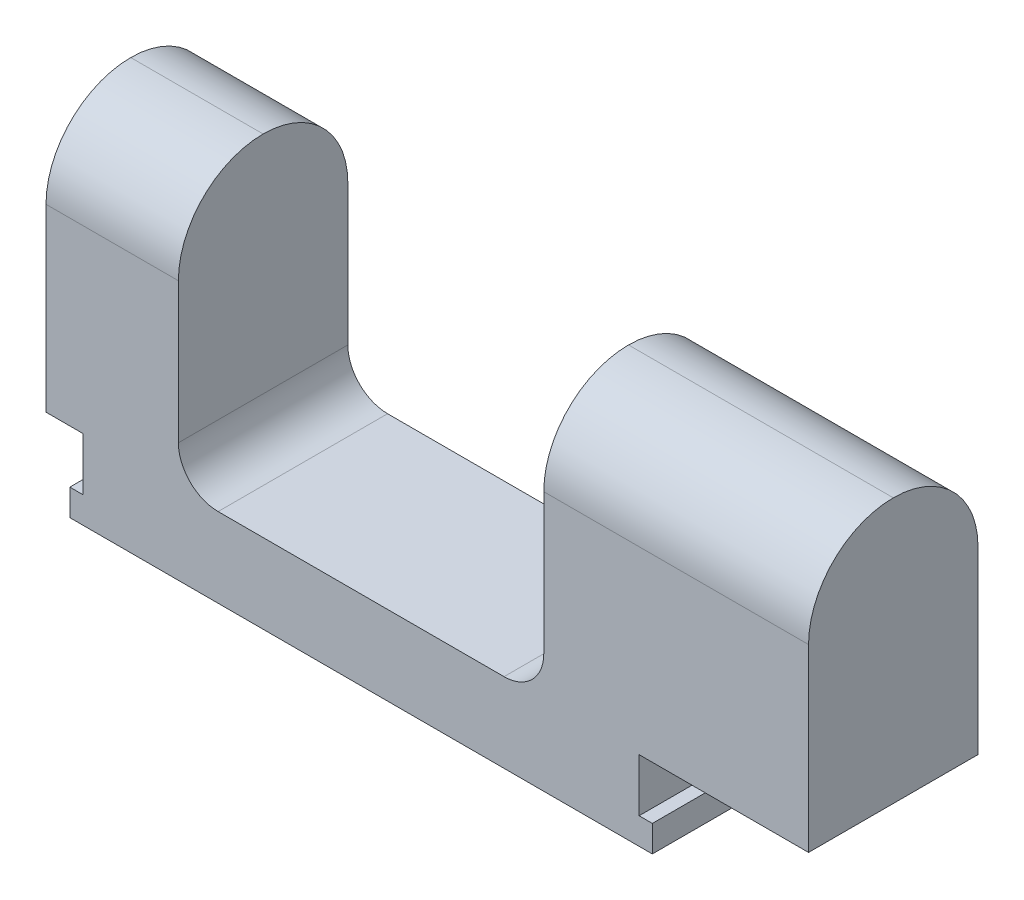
ISO-10303-21;
HEADER;
FILE_DESCRIPTION(('STEP AP214'),'2;1');
FILE_NAME('part.step','',(''),(''),'','','');
FILE_SCHEMA(('AUTOMOTIVE_DESIGN { 1 0 10303 214 1 1 1 1 }'));
ENDSEC;
DATA;
#1=APPLICATION_CONTEXT('core data for automotive mechanical design processes');
#2=APPLICATION_PROTOCOL_DEFINITION('international standard','automotive_design',2000,#1);
#3=PRODUCT_CONTEXT('',#1,'mechanical');
#4=PRODUCT('Part','Part','',(#3));
#5=PRODUCT_RELATED_PRODUCT_CATEGORY('part','',(#4));
#6=PRODUCT_DEFINITION_FORMATION('','',#4);
#7=PRODUCT_DEFINITION_CONTEXT('part definition',#1,'design');
#8=PRODUCT_DEFINITION('design','',#6,#7);
#9=PRODUCT_DEFINITION_SHAPE('','',#8);
#10=(LENGTH_UNIT() NAMED_UNIT(*) SI_UNIT(.MILLI.,.METRE.));
#11=(NAMED_UNIT(*) PLANE_ANGLE_UNIT() SI_UNIT($,.RADIAN.));
#12=(NAMED_UNIT(*) SI_UNIT($,.STERADIAN.) SOLID_ANGLE_UNIT());
#13=UNCERTAINTY_MEASURE_WITH_UNIT(LENGTH_MEASURE(1.E-05),#10,'distance_accuracy_value','');
#14=(GEOMETRIC_REPRESENTATION_CONTEXT(3) GLOBAL_UNCERTAINTY_ASSIGNED_CONTEXT((#13)) GLOBAL_UNIT_ASSIGNED_CONTEXT((#10,
#11,#12)) REPRESENTATION_CONTEXT('',''));
#15=CARTESIAN_POINT('',(0.,0.,0.));
#16=DIRECTION('',(0.,0.,1.));
#17=DIRECTION('',(1.,0.,0.));
#18=AXIS2_PLACEMENT_3D('',#15,#16,#17);
#19=CARTESIAN_POINT('',(-550.,50.,160.));
#20=DIRECTION('',(1.,0.,0.));
#21=DIRECTION('',(0.,0.,-1.));
#22=AXIS2_PLACEMENT_3D('',#19,#20,#21);
#23=PLANE('',#22);
#24=DIRECTION('',(0.,-1.,0.));
#25=VECTOR('',#24,1.);
#26=CARTESIAN_POINT('',(-550.,50.,-160.));
#27=LINE('',#26,#25);
#28=CARTESIAN_POINT('',(-550.,50.,-160.));
#29=VERTEX_POINT('',#28);
#30=CARTESIAN_POINT('',(-550.,0.,-160.));
#31=VERTEX_POINT('',#30);
#32=EDGE_CURVE('E167',#29,#31,#27,.T.);
#33=ORIENTED_EDGE('',*,*,#32,.T.);
#34=DIRECTION('',(0.,0.,-1.));
#35=VECTOR('',#34,1.);
#36=CARTESIAN_POINT('',(-550.,0.,160.));
#37=LINE('',#36,#35);
#38=CARTESIAN_POINT('',(-550.,0.,160.));
#39=VERTEX_POINT('',#38);
#40=EDGE_CURVE('E175',#39,#31,#37,.T.);
#41=ORIENTED_EDGE('',*,*,#40,.F.);
#42=DIRECTION('',(0.,-1.,0.));
#43=VECTOR('',#42,1.);
#44=CARTESIAN_POINT('',(-550.,50.,160.));
#45=LINE('',#44,#43);
#46=CARTESIAN_POINT('',(-550.,50.,160.));
#47=VERTEX_POINT('',#46);
#48=EDGE_CURVE('E222',#47,#39,#45,.T.);
#49=ORIENTED_EDGE('',*,*,#48,.F.);
#50=DIRECTION('',(0.,0.,-1.));
#51=VECTOR('',#50,1.);
#52=CARTESIAN_POINT('',(-550.,50.,160.));
#53=LINE('',#52,#51);
#54=EDGE_CURVE('E186',#47,#29,#53,.T.);
#55=ORIENTED_EDGE('',*,*,#54,.T.);
#56=EDGE_LOOP('',(#33,#41,#49,#55));
#57=FACE_BOUND('',#56,.T.);
#58=ADVANCED_FACE('F26',(#57),#23,.F.);
#59=CARTESIAN_POINT('',(-550.,0.,160.));
#60=DIRECTION('',(0.,1.,0.));
#61=DIRECTION('',(0.,0.,1.));
#62=AXIS2_PLACEMENT_3D('',#59,#60,#61);
#63=PLANE('',#62);
#64=DIRECTION('',(1.,0.,0.));
#65=VECTOR('',#64,1.);
#66=CARTESIAN_POINT('',(-550.,0.,-160.));
#67=LINE('',#66,#65);
#68=CARTESIAN_POINT('',(550.,0.,-160.));
#69=VERTEX_POINT('',#68);
#70=EDGE_CURVE('E161',#31,#69,#67,.T.);
#71=ORIENTED_EDGE('',*,*,#70,.T.);
#72=DIRECTION('',(0.,0.,-1.));
#73=VECTOR('',#72,1.);
#74=CARTESIAN_POINT('',(550.,0.,160.));
#75=LINE('',#74,#73);
#76=CARTESIAN_POINT('',(550.,0.,160.));
#77=VERTEX_POINT('',#76);
#78=EDGE_CURVE('E182',#77,#69,#75,.T.);
#79=ORIENTED_EDGE('',*,*,#78,.F.);
#80=DIRECTION('',(1.,0.,0.));
#81=VECTOR('',#80,1.);
#82=CARTESIAN_POINT('',(-550.,0.,160.));
#83=LINE('',#82,#81);
#84=EDGE_CURVE('E177',#39,#77,#83,.T.);
#85=ORIENTED_EDGE('',*,*,#84,.F.);
#86=ORIENTED_EDGE('',*,*,#40,.T.);
#87=EDGE_LOOP('',(#71,#79,#85,#86));
#88=FACE_BOUND('',#87,.T.);
#89=ADVANCED_FACE('F176',(#88),#63,.F.);
#90=CARTESIAN_POINT('',(550.,50.,160.));
#91=DIRECTION('',(-1.,0.,0.));
#92=DIRECTION('',(0.,0.,1.));
#93=AXIS2_PLACEMENT_3D('',#90,#91,#92);
#94=PLANE('',#93);
#95=DIRECTION('',(0.,1.,0.));
#96=VECTOR('',#95,1.);
#97=CARTESIAN_POINT('',(550.,50.,-160.));
#98=LINE('',#97,#96);
#99=CARTESIAN_POINT('',(550.,50.,-160.));
#100=VERTEX_POINT('',#99);
#101=EDGE_CURVE('E169',#69,#100,#98,.T.);
#102=ORIENTED_EDGE('',*,*,#101,.T.);
#103=DIRECTION('',(0.,0.,-1.));
#104=VECTOR('',#103,1.);
#105=CARTESIAN_POINT('',(550.,50.,160.));
#106=LINE('',#105,#104);
#107=CARTESIAN_POINT('',(550.,50.,160.));
#108=VERTEX_POINT('',#107);
#109=EDGE_CURVE('E286',#108,#100,#106,.T.);
#110=ORIENTED_EDGE('',*,*,#109,.F.);
#111=DIRECTION('',(0.,1.,0.));
#112=VECTOR('',#111,1.);
#113=CARTESIAN_POINT('',(550.,50.,160.));
#114=LINE('',#113,#112);
#115=EDGE_CURVE('E225',#77,#108,#114,.T.);
#116=ORIENTED_EDGE('',*,*,#115,.F.);
#117=ORIENTED_EDGE('',*,*,#78,.T.);
#118=EDGE_LOOP('',(#102,#110,#116,#117));
#119=FACE_BOUND('',#118,.T.);
#120=ADVANCED_FACE('F353',(#119),#94,.F.);
#121=CARTESIAN_POINT('',(550.,50.,160.));
#122=DIRECTION('',(0.,-1.,0.));
#123=DIRECTION('',(1.,0.,0.));
#124=AXIS2_PLACEMENT_3D('',#121,#122,#123);
#125=PLANE('',#124);
#126=DIRECTION('',(-1.,0.,0.));
#127=VECTOR('',#126,1.);
#128=CARTESIAN_POINT('',(550.,50.,-160.));
#129=LINE('',#128,#127);
#130=CARTESIAN_POINT('',(525.,50.,-160.));
#131=VERTEX_POINT('',#130);
#132=EDGE_CURVE('E195',#100,#131,#129,.T.);
#133=ORIENTED_EDGE('',*,*,#132,.T.);
#134=DIRECTION('',(0.,0.,-1.));
#135=VECTOR('',#134,1.);
#136=CARTESIAN_POINT('',(525.,50.,160.));
#137=LINE('',#136,#135);
#138=CARTESIAN_POINT('',(525.,50.,160.));
#139=VERTEX_POINT('',#138);
#140=EDGE_CURVE('E283',#139,#131,#137,.T.);
#141=ORIENTED_EDGE('',*,*,#140,.F.);
#142=DIRECTION('',(-1.,0.,0.));
#143=VECTOR('',#142,1.);
#144=CARTESIAN_POINT('',(550.,50.,160.));
#145=LINE('',#144,#143);
#146=EDGE_CURVE('E227',#108,#139,#145,.T.);
#147=ORIENTED_EDGE('',*,*,#146,.F.);
#148=ORIENTED_EDGE('',*,*,#109,.T.);
#149=EDGE_LOOP('',(#133,#141,#147,#148));
#150=FACE_BOUND('',#149,.T.);
#151=ADVANCED_FACE('F357',(#150),#125,.F.);
#152=CARTESIAN_POINT('',(525.,50.,160.));
#153=DIRECTION('',(-1.,0.,0.));
#154=DIRECTION('',(0.,0.,1.));
#155=AXIS2_PLACEMENT_3D('',#152,#153,#154);
#156=PLANE('',#155);
#157=DIRECTION('',(0.,1.,0.));
#158=VECTOR('',#157,1.);
#159=CARTESIAN_POINT('',(525.,50.,-160.));
#160=LINE('',#159,#158);
#161=CARTESIAN_POINT('',(525.,150.,-160.));
#162=VERTEX_POINT('',#161);
#163=EDGE_CURVE('E197',#131,#162,#160,.T.);
#164=ORIENTED_EDGE('',*,*,#163,.T.);
#165=DIRECTION('',(0.,0.,-1.));
#166=VECTOR('',#165,1.);
#167=CARTESIAN_POINT('',(525.,150.,160.));
#168=LINE('',#167,#166);
#169=CARTESIAN_POINT('',(525.,150.,160.));
#170=VERTEX_POINT('',#169);
#171=EDGE_CURVE('E280',#170,#162,#168,.T.);
#172=ORIENTED_EDGE('',*,*,#171,.F.);
#173=DIRECTION('',(0.,1.,0.));
#174=VECTOR('',#173,1.);
#175=CARTESIAN_POINT('',(525.,50.,160.));
#176=LINE('',#175,#174);
#177=EDGE_CURVE('E229',#139,#170,#176,.T.);
#178=ORIENTED_EDGE('',*,*,#177,.F.);
#179=ORIENTED_EDGE('',*,*,#140,.T.);
#180=EDGE_LOOP('',(#164,#172,#178,#179));
#181=FACE_BOUND('',#180,.T.);
#182=ADVANCED_FACE('F363',(#181),#156,.F.);
#183=CARTESIAN_POINT('',(525.,150.,160.));
#184=DIRECTION('',(0.,1.,0.));
#185=DIRECTION('',(0.,0.,1.));
#186=AXIS2_PLACEMENT_3D('',#183,#184,#185);
#187=PLANE('',#186);
#188=DIRECTION('',(1.,0.,0.));
#189=VECTOR('',#188,1.);
#190=CARTESIAN_POINT('',(525.,150.,-160.));
#191=LINE('',#190,#189);
#192=CARTESIAN_POINT('',(845.,150.,-160.));
#193=VERTEX_POINT('',#192);
#194=EDGE_CURVE('E199',#162,#193,#191,.T.);
#195=ORIENTED_EDGE('',*,*,#194,.T.);
#196=DIRECTION('',(0.,0.,-1.));
#197=VECTOR('',#196,1.);
#198=CARTESIAN_POINT('',(845.,150.,160.));
#199=LINE('',#198,#197);
#200=CARTESIAN_POINT('',(845.,150.,160.));
#201=VERTEX_POINT('',#200);
#202=EDGE_CURVE('E277',#201,#193,#199,.T.);
#203=ORIENTED_EDGE('',*,*,#202,.F.);
#204=DIRECTION('',(1.,0.,0.));
#205=VECTOR('',#204,1.);
#206=CARTESIAN_POINT('',(525.,150.,160.));
#207=LINE('',#206,#205);
#208=EDGE_CURVE('E231',#170,#201,#207,.T.);
#209=ORIENTED_EDGE('',*,*,#208,.F.);
#210=ORIENTED_EDGE('',*,*,#171,.T.);
#211=EDGE_LOOP('',(#195,#203,#209,#210));
#212=FACE_BOUND('',#211,.T.);
#213=ADVANCED_FACE('F367',(#212),#187,.F.);
#214=CARTESIAN_POINT('',(845.,650.,160.));
#215=DIRECTION('',(-1.,0.,0.));
#216=DIRECTION('',(0.,0.,1.));
#217=AXIS2_PLACEMENT_3D('',#214,#215,#216);
#218=PLANE('',#217);
#219=DIRECTION('',(0.,1.,0.));
#220=VECTOR('',#219,1.);
#221=CARTESIAN_POINT('',(845.,650.,-160.));
#222=LINE('',#221,#220);
#223=CARTESIAN_POINT('',(845.,490.,-160.));
#224=VERTEX_POINT('',#223);
#225=EDGE_CURVE('E201',#193,#224,#222,.T.);
#226=ORIENTED_EDGE('',*,*,#225,.T.);
#227=CARTESIAN_POINT('',(845.,490.,0.));
#228=DIRECTION('',(-1.,0.,0.));
#229=DIRECTION('',(0.,0.,1.));
#230=AXIS2_PLACEMENT_3D('',#227,#228,#229);
#231=CIRCLE('',#230,160.);
#232=CARTESIAN_POINT('',(845.,650.,0.));
#233=VERTEX_POINT('',#232);
#234=EDGE_CURVE('E301',#224,#233,#231,.F.);
#235=ORIENTED_EDGE('',*,*,#234,.T.);
#236=CARTESIAN_POINT('',(845.,490.,0.));
#237=DIRECTION('',(-1.,0.,0.));
#238=DIRECTION('',(0.,0.,1.));
#239=AXIS2_PLACEMENT_3D('',#236,#237,#238);
#240=CIRCLE('',#239,160.);
#241=CARTESIAN_POINT('',(845.,490.,160.));
#242=VERTEX_POINT('',#241);
#243=EDGE_CURVE('E299',#233,#242,#240,.F.);
#244=ORIENTED_EDGE('',*,*,#243,.T.);
#245=DIRECTION('',(0.,1.,0.));
#246=VECTOR('',#245,1.);
#247=CARTESIAN_POINT('',(845.,650.,160.));
#248=LINE('',#247,#246);
#249=EDGE_CURVE('E233',#201,#242,#248,.T.);
#250=ORIENTED_EDGE('',*,*,#249,.F.);
#251=ORIENTED_EDGE('',*,*,#202,.T.);
#252=EDGE_LOOP('',(#226,#235,#244,#250,#251));
#253=FACE_BOUND('',#252,.T.);
#254=ADVANCED_FACE('F371',(#253),#218,.F.);
#255=CARTESIAN_POINT('',(345.,650.,160.));
#256=DIRECTION('',(1.,0.,0.));
#257=DIRECTION('',(0.,1.,0.));
#258=AXIS2_PLACEMENT_3D('',#255,#256,#257);
#259=PLANE('',#258);
#260=CARTESIAN_POINT('',(345.,490.,0.));
#261=DIRECTION('',(1.,0.,0.));
#262=DIRECTION('',(0.,1.,0.));
#263=AXIS2_PLACEMENT_3D('',#260,#261,#262);
#264=CIRCLE('',#263,160.);
#265=CARTESIAN_POINT('',(345.,490.,160.));
#266=VERTEX_POINT('',#265);
#267=CARTESIAN_POINT('',(345.,650.,0.));
#268=VERTEX_POINT('',#267);
#269=EDGE_CURVE('E181',#266,#268,#264,.F.);
#270=ORIENTED_EDGE('',*,*,#269,.T.);
#271=CARTESIAN_POINT('',(345.,490.,0.));
#272=DIRECTION('',(1.,0.,0.));
#273=DIRECTION('',(0.,1.,0.));
#274=AXIS2_PLACEMENT_3D('',#271,#272,#273);
#275=CIRCLE('',#274,160.);
#276=CARTESIAN_POINT('',(345.,490.,-160.));
#277=VERTEX_POINT('',#276);
#278=EDGE_CURVE('E291',#268,#277,#275,.F.);
#279=ORIENTED_EDGE('',*,*,#278,.T.);
#280=DIRECTION('',(0.,-1.,0.));
#281=VECTOR('',#280,1.);
#282=CARTESIAN_POINT('',(345.,650.,-160.));
#283=LINE('',#282,#281);
#284=CARTESIAN_POINT('',(345.,225.,-160.));
#285=VERTEX_POINT('',#284);
#286=EDGE_CURVE('E204',#277,#285,#283,.T.);
#287=ORIENTED_EDGE('',*,*,#286,.T.);
#288=DIRECTION('',(0.,0.,-1.));
#289=VECTOR('',#288,1.);
#290=CARTESIAN_POINT('',(345.,225.,160.));
#291=LINE('',#290,#289);
#292=CARTESIAN_POINT('',(345.,225.,160.));
#293=VERTEX_POINT('',#292);
#294=EDGE_CURVE('E274',#293,#285,#291,.T.);
#295=ORIENTED_EDGE('',*,*,#294,.F.);
#296=DIRECTION('',(0.,-1.,0.));
#297=VECTOR('',#296,1.);
#298=CARTESIAN_POINT('',(345.,650.,160.));
#299=LINE('',#298,#297);
#300=EDGE_CURVE('E236',#266,#293,#299,.T.);
#301=ORIENTED_EDGE('',*,*,#300,.F.);
#302=EDGE_LOOP('',(#270,#279,#287,#295,#301));
#303=FACE_BOUND('',#302,.T.);
#304=ADVANCED_FACE('F374',(#303),#259,.F.);
#305=CARTESIAN_POINT('',(270.,225.,160.));
#306=DIRECTION('',(0.,0.,-1.));
#307=DIRECTION('',(-1.,0.,0.));
#308=AXIS2_PLACEMENT_3D('',#305,#306,#307);
#309=CYLINDRICAL_SURFACE('',#308,75.);
#310=CARTESIAN_POINT('',(270.,225.,-160.));
#311=DIRECTION('',(0.,0.,-1.));
#312=DIRECTION('',(-1.,0.,0.));
#313=AXIS2_PLACEMENT_3D('',#310,#311,#312);
#314=CIRCLE('',#313,75.);
#315=CARTESIAN_POINT('',(270.,150.,-160.));
#316=VERTEX_POINT('',#315);
#317=EDGE_CURVE('E206',#285,#316,#314,.T.);
#318=ORIENTED_EDGE('',*,*,#317,.T.);
#319=DIRECTION('',(0.,0.,-1.));
#320=VECTOR('',#319,1.);
#321=CARTESIAN_POINT('',(270.,150.,160.));
#322=LINE('',#321,#320);
#323=CARTESIAN_POINT('',(270.,150.,160.));
#324=VERTEX_POINT('',#323);
#325=EDGE_CURVE('E271',#324,#316,#322,.T.);
#326=ORIENTED_EDGE('',*,*,#325,.F.);
#327=CARTESIAN_POINT('',(270.,225.,160.));
#328=DIRECTION('',(0.,0.,-1.));
#329=DIRECTION('',(-1.,0.,0.));
#330=AXIS2_PLACEMENT_3D('',#327,#328,#329);
#331=CIRCLE('',#330,75.);
#332=EDGE_CURVE('E238',#293,#324,#331,.T.);
#333=ORIENTED_EDGE('',*,*,#332,.F.);
#334=ORIENTED_EDGE('',*,*,#294,.T.);
#335=EDGE_LOOP('',(#318,#326,#333,#334));
#336=FACE_BOUND('',#335,.T.);
#337=ADVANCED_FACE('F378',(#336),#309,.F.);
#338=CARTESIAN_POINT('',(270.,150.,160.));
#339=DIRECTION('',(0.,-1.,0.));
#340=DIRECTION('',(1.,0.,0.));
#341=AXIS2_PLACEMENT_3D('',#338,#339,#340);
#342=PLANE('',#341);
#343=DIRECTION('',(-1.,0.,0.));
#344=VECTOR('',#343,1.);
#345=CARTESIAN_POINT('',(270.,150.,-160.));
#346=LINE('',#345,#344);
#347=CARTESIAN_POINT('',(-270.,150.,-160.));
#348=VERTEX_POINT('',#347);
#349=EDGE_CURVE('E208',#316,#348,#346,.T.);
#350=ORIENTED_EDGE('',*,*,#349,.T.);
#351=DIRECTION('',(0.,0.,-1.));
#352=VECTOR('',#351,1.);
#353=CARTESIAN_POINT('',(-270.,150.,160.));
#354=LINE('',#353,#352);
#355=CARTESIAN_POINT('',(-270.,150.,160.));
#356=VERTEX_POINT('',#355);
#357=EDGE_CURVE('E268',#356,#348,#354,.T.);
#358=ORIENTED_EDGE('',*,*,#357,.F.);
#359=DIRECTION('',(-1.,0.,0.));
#360=VECTOR('',#359,1.);
#361=CARTESIAN_POINT('',(270.,150.,160.));
#362=LINE('',#361,#360);
#363=EDGE_CURVE('E240',#324,#356,#362,.T.);
#364=ORIENTED_EDGE('',*,*,#363,.F.);
#365=ORIENTED_EDGE('',*,*,#325,.T.);
#366=EDGE_LOOP('',(#350,#358,#364,#365));
#367=FACE_BOUND('',#366,.T.);
#368=ADVANCED_FACE('F382',(#367),#342,.F.);
#369=CARTESIAN_POINT('',(-270.,225.,160.));
#370=DIRECTION('',(0.,0.,-1.));
#371=DIRECTION('',(-1.,0.,0.));
#372=AXIS2_PLACEMENT_3D('',#369,#370,#371);
#373=CYLINDRICAL_SURFACE('',#372,75.);
#374=CARTESIAN_POINT('',(-270.,225.,-160.));
#375=DIRECTION('',(0.,0.,-1.));
#376=DIRECTION('',(-1.,0.,0.));
#377=AXIS2_PLACEMENT_3D('',#374,#375,#376);
#378=CIRCLE('',#377,75.);
#379=CARTESIAN_POINT('',(-345.,225.,-160.));
#380=VERTEX_POINT('',#379);
#381=EDGE_CURVE('E210',#348,#380,#378,.T.);
#382=ORIENTED_EDGE('',*,*,#381,.T.);
#383=DIRECTION('',(0.,0.,-1.));
#384=VECTOR('',#383,1.);
#385=CARTESIAN_POINT('',(-345.,225.,160.));
#386=LINE('',#385,#384);
#387=CARTESIAN_POINT('',(-345.,225.,160.));
#388=VERTEX_POINT('',#387);
#389=EDGE_CURVE('E265',#388,#380,#386,.T.);
#390=ORIENTED_EDGE('',*,*,#389,.F.);
#391=CARTESIAN_POINT('',(-270.,225.,160.));
#392=DIRECTION('',(0.,0.,-1.));
#393=DIRECTION('',(-1.,0.,0.));
#394=AXIS2_PLACEMENT_3D('',#391,#392,#393);
#395=CIRCLE('',#394,75.);
#396=EDGE_CURVE('E242',#356,#388,#395,.T.);
#397=ORIENTED_EDGE('',*,*,#396,.F.);
#398=ORIENTED_EDGE('',*,*,#357,.T.);
#399=EDGE_LOOP('',(#382,#390,#397,#398));
#400=FACE_BOUND('',#399,.T.);
#401=ADVANCED_FACE('F386',(#400),#373,.F.);
#402=CARTESIAN_POINT('',(-345.,225.,160.));
#403=DIRECTION('',(-1.,0.,0.));
#404=DIRECTION('',(0.,0.,1.));
#405=AXIS2_PLACEMENT_3D('',#402,#403,#404);
#406=PLANE('',#405);
#407=DIRECTION('',(0.,1.,0.));
#408=VECTOR('',#407,1.);
#409=CARTESIAN_POINT('',(-345.,225.,-160.));
#410=LINE('',#409,#408);
#411=CARTESIAN_POINT('',(-345.,490.,-160.));
#412=VERTEX_POINT('',#411);
#413=EDGE_CURVE('E212',#380,#412,#410,.T.);
#414=ORIENTED_EDGE('',*,*,#413,.T.);
#415=CARTESIAN_POINT('',(-345.,490.,0.));
#416=DIRECTION('',(-1.,0.,0.));
#417=DIRECTION('',(0.,0.,1.));
#418=AXIS2_PLACEMENT_3D('',#415,#416,#417);
#419=CIRCLE('',#418,160.);
#420=CARTESIAN_POINT('',(-345.,650.,0.));
#421=VERTEX_POINT('',#420);
#422=EDGE_CURVE('E11',#412,#421,#419,.F.);
#423=ORIENTED_EDGE('',*,*,#422,.T.);
#424=CARTESIAN_POINT('',(-345.,490.,0.));
#425=DIRECTION('',(-1.,0.,0.));
#426=DIRECTION('',(0.,0.,1.));
#427=AXIS2_PLACEMENT_3D('',#424,#425,#426);
#428=CIRCLE('',#427,160.);
#429=CARTESIAN_POINT('',(-345.,490.,160.));
#430=VERTEX_POINT('',#429);
#431=EDGE_CURVE('E33',#421,#430,#428,.F.);
#432=ORIENTED_EDGE('',*,*,#431,.T.);
#433=DIRECTION('',(0.,1.,0.));
#434=VECTOR('',#433,1.);
#435=CARTESIAN_POINT('',(-345.,225.,160.));
#436=LINE('',#435,#434);
#437=EDGE_CURVE('E244',#388,#430,#436,.T.);
#438=ORIENTED_EDGE('',*,*,#437,.F.);
#439=ORIENTED_EDGE('',*,*,#389,.T.);
#440=EDGE_LOOP('',(#414,#423,#432,#438,#439));
#441=FACE_BOUND('',#440,.T.);
#442=ADVANCED_FACE('F310',(#441),#406,.F.);
#443=CARTESIAN_POINT('',(-595.,150.,160.));
#444=DIRECTION('',(1.,0.,0.));
#445=DIRECTION('',(0.,0.,-1.));
#446=AXIS2_PLACEMENT_3D('',#443,#444,#445);
#447=PLANE('',#446);
#448=CARTESIAN_POINT('',(-595.,490.,0.));
#449=DIRECTION('',(1.,0.,0.));
#450=DIRECTION('',(0.,0.,-1.));
#451=AXIS2_PLACEMENT_3D('',#448,#449,#450);
#452=CIRCLE('',#451,160.);
#453=CARTESIAN_POINT('',(-595.,490.,160.));
#454=VERTEX_POINT('',#453);
#455=CARTESIAN_POINT('',(-595.,650.,0.));
#456=VERTEX_POINT('',#455);
#457=EDGE_CURVE('E46',#454,#456,#452,.F.);
#458=ORIENTED_EDGE('',*,*,#457,.T.);
#459=CARTESIAN_POINT('',(-595.,490.,0.));
#460=DIRECTION('',(1.,0.,0.));
#461=DIRECTION('',(0.,0.,-1.));
#462=AXIS2_PLACEMENT_3D('',#459,#460,#461);
#463=CIRCLE('',#462,160.);
#464=CARTESIAN_POINT('',(-595.,490.,-160.));
#465=VERTEX_POINT('',#464);
#466=EDGE_CURVE('E308',#456,#465,#463,.F.);
#467=ORIENTED_EDGE('',*,*,#466,.T.);
#468=DIRECTION('',(0.,-1.,0.));
#469=VECTOR('',#468,1.);
#470=CARTESIAN_POINT('',(-595.,150.,-160.));
#471=LINE('',#470,#469);
#472=CARTESIAN_POINT('',(-595.,150.,-160.));
#473=VERTEX_POINT('',#472);
#474=EDGE_CURVE('E214',#465,#473,#471,.T.);
#475=ORIENTED_EDGE('',*,*,#474,.T.);
#476=DIRECTION('',(0.,0.,-1.));
#477=VECTOR('',#476,1.);
#478=CARTESIAN_POINT('',(-595.,150.,160.));
#479=LINE('',#478,#477);
#480=CARTESIAN_POINT('',(-595.,150.,160.));
#481=VERTEX_POINT('',#480);
#482=EDGE_CURVE('E262',#481,#473,#479,.T.);
#483=ORIENTED_EDGE('',*,*,#482,.F.);
#484=DIRECTION('',(0.,-1.,0.));
#485=VECTOR('',#484,1.);
#486=CARTESIAN_POINT('',(-595.,150.,160.));
#487=LINE('',#486,#485);
#488=EDGE_CURVE('E247',#454,#481,#487,.T.);
#489=ORIENTED_EDGE('',*,*,#488,.F.);
#490=EDGE_LOOP('',(#458,#467,#475,#483,#489));
#491=FACE_BOUND('',#490,.T.);
#492=ADVANCED_FACE('F324',(#491),#447,.F.);
#493=CARTESIAN_POINT('',(-525.,150.,160.));
#494=DIRECTION('',(0.,1.,0.));
#495=DIRECTION('',(0.,0.,1.));
#496=AXIS2_PLACEMENT_3D('',#493,#494,#495);
#497=PLANE('',#496);
#498=DIRECTION('',(1.,0.,0.));
#499=VECTOR('',#498,1.);
#500=CARTESIAN_POINT('',(-525.,150.,-160.));
#501=LINE('',#500,#499);
#502=CARTESIAN_POINT('',(-525.,150.,-160.));
#503=VERTEX_POINT('',#502);
#504=EDGE_CURVE('E216',#473,#503,#501,.T.);
#505=ORIENTED_EDGE('',*,*,#504,.T.);
#506=DIRECTION('',(0.,0.,-1.));
#507=VECTOR('',#506,1.);
#508=CARTESIAN_POINT('',(-525.,150.,160.));
#509=LINE('',#508,#507);
#510=CARTESIAN_POINT('',(-525.,150.,160.));
#511=VERTEX_POINT('',#510);
#512=EDGE_CURVE('E259',#511,#503,#509,.T.);
#513=ORIENTED_EDGE('',*,*,#512,.F.);
#514=DIRECTION('',(1.,0.,0.));
#515=VECTOR('',#514,1.);
#516=CARTESIAN_POINT('',(-525.,150.,160.));
#517=LINE('',#516,#515);
#518=EDGE_CURVE('E249',#481,#511,#517,.T.);
#519=ORIENTED_EDGE('',*,*,#518,.F.);
#520=ORIENTED_EDGE('',*,*,#482,.T.);
#521=EDGE_LOOP('',(#505,#513,#519,#520));
#522=FACE_BOUND('',#521,.T.);
#523=ADVANCED_FACE('F331',(#522),#497,.F.);
#524=CARTESIAN_POINT('',(-525.,50.,160.));
#525=DIRECTION('',(1.,0.,0.));
#526=DIRECTION('',(0.,0.,-1.));
#527=AXIS2_PLACEMENT_3D('',#524,#525,#526);
#528=PLANE('',#527);
#529=DIRECTION('',(0.,-1.,0.));
#530=VECTOR('',#529,1.);
#531=CARTESIAN_POINT('',(-525.,50.,-160.));
#532=LINE('',#531,#530);
#533=CARTESIAN_POINT('',(-525.,50.,-160.));
#534=VERTEX_POINT('',#533);
#535=EDGE_CURVE('E218',#503,#534,#532,.T.);
#536=ORIENTED_EDGE('',*,*,#535,.T.);
#537=DIRECTION('',(0.,0.,-1.));
#538=VECTOR('',#537,1.);
#539=CARTESIAN_POINT('',(-525.,50.,160.));
#540=LINE('',#539,#538);
#541=CARTESIAN_POINT('',(-525.,50.,160.));
#542=VERTEX_POINT('',#541);
#543=EDGE_CURVE('E256',#542,#534,#540,.T.);
#544=ORIENTED_EDGE('',*,*,#543,.F.);
#545=DIRECTION('',(0.,-1.,0.));
#546=VECTOR('',#545,1.);
#547=CARTESIAN_POINT('',(-525.,50.,160.));
#548=LINE('',#547,#546);
#549=EDGE_CURVE('E251',#511,#542,#548,.T.);
#550=ORIENTED_EDGE('',*,*,#549,.F.);
#551=ORIENTED_EDGE('',*,*,#512,.T.);
#552=EDGE_LOOP('',(#536,#544,#550,#551));
#553=FACE_BOUND('',#552,.T.);
#554=ADVANCED_FACE('F335',(#553),#528,.F.);
#555=CARTESIAN_POINT('',(-550.,50.,160.));
#556=DIRECTION('',(0.,-1.,0.));
#557=DIRECTION('',(0.,0.,-1.));
#558=AXIS2_PLACEMENT_3D('',#555,#556,#557);
#559=PLANE('',#558);
#560=DIRECTION('',(-1.,0.,0.));
#561=VECTOR('',#560,1.);
#562=CARTESIAN_POINT('',(-550.,50.,-160.));
#563=LINE('',#562,#561);
#564=EDGE_CURVE('E220',#534,#29,#563,.T.);
#565=ORIENTED_EDGE('',*,*,#564,.T.);
#566=ORIENTED_EDGE('',*,*,#54,.F.);
#567=DIRECTION('',(-1.,0.,0.));
#568=VECTOR('',#567,1.);
#569=CARTESIAN_POINT('',(-550.,50.,160.));
#570=LINE('',#569,#568);
#571=EDGE_CURVE('E253',#542,#47,#570,.T.);
#572=ORIENTED_EDGE('',*,*,#571,.F.);
#573=ORIENTED_EDGE('',*,*,#543,.T.);
#574=EDGE_LOOP('',(#565,#566,#572,#573));
#575=FACE_BOUND('',#574,.T.);
#576=ADVANCED_FACE('F339',(#575),#559,.F.);
#577=CARTESIAN_POINT('',(270.,225.,160.));
#578=DIRECTION('',(0.,0.,-1.));
#579=DIRECTION('',(-1.,0.,0.));
#580=AXIS2_PLACEMENT_3D('',#577,#578,#579);
#581=PLANE('',#580);
#582=ORIENTED_EDGE('',*,*,#249,.T.);
#583=DIRECTION('',(-1.,0.,0.));
#584=VECTOR('',#583,1.);
#585=CARTESIAN_POINT('',(270.,490.,160.));
#586=LINE('',#585,#584);
#587=EDGE_CURVE('E305',#242,#266,#586,.T.);
#588=ORIENTED_EDGE('',*,*,#587,.T.);
#589=ORIENTED_EDGE('',*,*,#300,.T.);
#590=ORIENTED_EDGE('',*,*,#332,.T.);
#591=ORIENTED_EDGE('',*,*,#363,.T.);
#592=ORIENTED_EDGE('',*,*,#396,.T.);
#593=ORIENTED_EDGE('',*,*,#437,.T.);
#594=DIRECTION('',(-1.,0.,0.));
#595=VECTOR('',#594,1.);
#596=CARTESIAN_POINT('',(270.,490.,160.));
#597=LINE('',#596,#595);
#598=EDGE_CURVE('E303',#430,#454,#597,.T.);
#599=ORIENTED_EDGE('',*,*,#598,.T.);
#600=ORIENTED_EDGE('',*,*,#488,.T.);
#601=ORIENTED_EDGE('',*,*,#518,.T.);
#602=ORIENTED_EDGE('',*,*,#549,.T.);
#603=ORIENTED_EDGE('',*,*,#571,.T.);
#604=ORIENTED_EDGE('',*,*,#48,.T.);
#605=ORIENTED_EDGE('',*,*,#84,.T.);
#606=ORIENTED_EDGE('',*,*,#115,.T.);
#607=ORIENTED_EDGE('',*,*,#146,.T.);
#608=ORIENTED_EDGE('',*,*,#177,.T.);
#609=ORIENTED_EDGE('',*,*,#208,.T.);
#610=EDGE_LOOP('',(#582,#588,#589,#590,#591,#592,#593,#599,#600,#601,#602,#603,#604,#605,#606,
#607,#608,#609));
#611=FACE_BOUND('',#610,.T.);
#612=ADVANCED_FACE('F315',(#611),#581,.F.);
#613=CARTESIAN_POINT('',(270.,225.,-160.));
#614=DIRECTION('',(0.,0.,-1.));
#615=DIRECTION('',(-1.,0.,0.));
#616=AXIS2_PLACEMENT_3D('',#613,#614,#615);
#617=PLANE('',#616);
#618=ORIENTED_EDGE('',*,*,#286,.F.);
#619=DIRECTION('',(-1.,0.,0.));
#620=VECTOR('',#619,1.);
#621=CARTESIAN_POINT('',(845.,490.,-160.));
#622=LINE('',#621,#620);
#623=EDGE_CURVE('E296',#277,#224,#622,.F.);
#624=ORIENTED_EDGE('',*,*,#623,.T.);
#625=ORIENTED_EDGE('',*,*,#225,.F.);
#626=ORIENTED_EDGE('',*,*,#194,.F.);
#627=ORIENTED_EDGE('',*,*,#163,.F.);
#628=ORIENTED_EDGE('',*,*,#132,.F.);
#629=ORIENTED_EDGE('',*,*,#101,.F.);
#630=ORIENTED_EDGE('',*,*,#70,.F.);
#631=ORIENTED_EDGE('',*,*,#32,.F.);
#632=ORIENTED_EDGE('',*,*,#564,.F.);
#633=ORIENTED_EDGE('',*,*,#535,.F.);
#634=ORIENTED_EDGE('',*,*,#504,.F.);
#635=ORIENTED_EDGE('',*,*,#474,.F.);
#636=DIRECTION('',(-1.,0.,0.));
#637=VECTOR('',#636,1.);
#638=CARTESIAN_POINT('',(-345.,490.,-160.));
#639=LINE('',#638,#637);
#640=EDGE_CURVE('E293',#465,#412,#639,.F.);
#641=ORIENTED_EDGE('',*,*,#640,.T.);
#642=ORIENTED_EDGE('',*,*,#413,.F.);
#643=ORIENTED_EDGE('',*,*,#381,.F.);
#644=ORIENTED_EDGE('',*,*,#349,.F.);
#645=ORIENTED_EDGE('',*,*,#317,.F.);
#646=EDGE_LOOP('',(#618,#624,#625,#626,#627,#628,#629,#630,#631,#632,#633,#634,#635,#641,#642,
#643,#644,#645));
#647=FACE_BOUND('',#646,.T.);
#648=ADVANCED_FACE('F164',(#647),#617,.T.);
#649=CARTESIAN_POINT('',(270.,490.,0.));
#650=DIRECTION('',(-1.,0.,0.));
#651=DIRECTION('',(0.,0.,1.));
#652=AXIS2_PLACEMENT_3D('',#649,#650,#651);
#653=CYLINDRICAL_SURFACE('',#652,160.);
#654=ORIENTED_EDGE('',*,*,#587,.F.);
#655=ORIENTED_EDGE('',*,*,#243,.F.);
#656=DIRECTION('',(-1.,0.,0.));
#657=VECTOR('',#656,1.);
#658=CARTESIAN_POINT('',(845.,650.,0.));
#659=LINE('',#658,#657);
#660=EDGE_CURVE('E187',#268,#233,#659,.F.);
#661=ORIENTED_EDGE('',*,*,#660,.F.);
#662=ORIENTED_EDGE('',*,*,#269,.F.);
#663=EDGE_LOOP('',(#654,#655,#661,#662));
#664=FACE_BOUND('',#663,.T.);
#665=ADVANCED_FACE('F418',(#664),#653,.T.);
#666=CARTESIAN_POINT('',(845.,490.,0.));
#667=DIRECTION('',(1.,0.,0.));
#668=DIRECTION('',(0.,0.,-1.));
#669=AXIS2_PLACEMENT_3D('',#666,#667,#668);
#670=CYLINDRICAL_SURFACE('',#669,160.);
#671=ORIENTED_EDGE('',*,*,#234,.F.);
#672=ORIENTED_EDGE('',*,*,#623,.F.);
#673=ORIENTED_EDGE('',*,*,#278,.F.);
#674=ORIENTED_EDGE('',*,*,#660,.T.);
#675=EDGE_LOOP('',(#671,#672,#673,#674));
#676=FACE_BOUND('',#675,.T.);
#677=ADVANCED_FACE('F425',(#676),#670,.T.);
#678=CARTESIAN_POINT('',(270.,490.,0.));
#679=DIRECTION('',(-1.,0.,0.));
#680=DIRECTION('',(0.,0.,1.));
#681=AXIS2_PLACEMENT_3D('',#678,#679,#680);
#682=CYLINDRICAL_SURFACE('',#681,160.);
#683=ORIENTED_EDGE('',*,*,#598,.F.);
#684=ORIENTED_EDGE('',*,*,#431,.F.);
#685=DIRECTION('',(-1.,0.,0.));
#686=VECTOR('',#685,1.);
#687=CARTESIAN_POINT('',(-345.,650.,0.));
#688=LINE('',#687,#686);
#689=EDGE_CURVE('E190',#456,#421,#688,.F.);
#690=ORIENTED_EDGE('',*,*,#689,.F.);
#691=ORIENTED_EDGE('',*,*,#457,.F.);
#692=EDGE_LOOP('',(#683,#684,#690,#691));
#693=FACE_BOUND('',#692,.T.);
#694=ADVANCED_FACE('F318',(#693),#682,.T.);
#695=CARTESIAN_POINT('',(-345.,490.,0.));
#696=DIRECTION('',(1.,0.,0.));
#697=DIRECTION('',(0.,0.,-1.));
#698=AXIS2_PLACEMENT_3D('',#695,#696,#697);
#699=CYLINDRICAL_SURFACE('',#698,160.);
#700=ORIENTED_EDGE('',*,*,#422,.F.);
#701=ORIENTED_EDGE('',*,*,#640,.F.);
#702=ORIENTED_EDGE('',*,*,#466,.F.);
#703=ORIENTED_EDGE('',*,*,#689,.T.);
#704=EDGE_LOOP('',(#700,#701,#702,#703));
#705=FACE_BOUND('',#704,.T.);
#706=ADVANCED_FACE('F322',(#705),#699,.T.);
#707=CLOSED_SHELL('',(#58,#89,#120,#151,#182,#213,#254,#304,#337,#368,#401,#442,#492,#523,#554,
#576,#612,#648,#665,#677,#694,#706));
#708=MANIFOLD_SOLID_BREP('B2',#707);
#709=ADVANCED_BREP_SHAPE_REPRESENTATION('',(#18,#708),#14);
#710=SHAPE_DEFINITION_REPRESENTATION(#9,#709);
ENDSEC;
END-ISO-10303-21;
